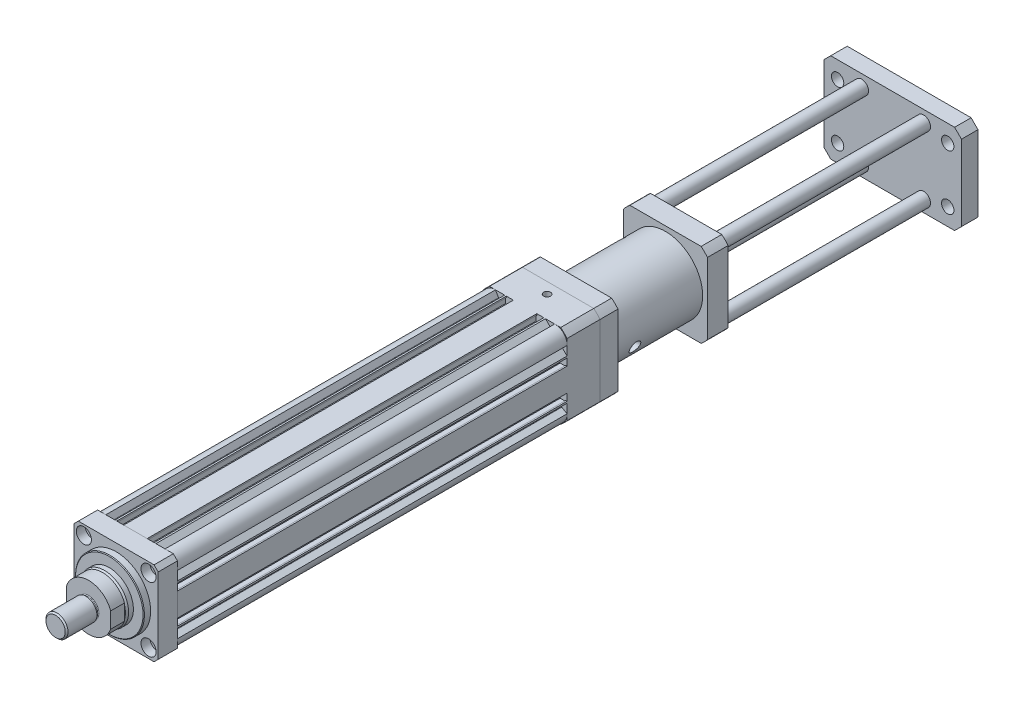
from build123d import *

# Parameters (mm, degrees)
SKETCH_1_R           = 25
SKETCH_1_R_2         = 2.594
EXTRUDE_1_DEPTH      = 283
EXTRUDE_1_2_DEPTH    = 14
SKETCH_3_R           = 4.5
SKETCH_3_R_2         = 3.5
CUT_EXTRUDE_3_DEPTH  = 14
SKETCH_3_5_R         = 5.5
CUT_EXTRUDE_4_DEPTH  = 6.5
SKETCH_5_R           = 25
EXTRUDE_2_DEPTH      = 5
CHAMFER_1_SIZE       = 0.5
SKETCH_6_R           = 17.5
EXTRUDE_3_DEPTH      = 5
CHAMFER_2_SIZE       = 1.5
CHAMFER_2_SIZE2      = 0.8
EXTRUDE_4_DEPTH      = 10
SKETCH_8_R           = 7
EXTRUDE_5_DEPTH      = 2
SKETCH_9_R           = 8
EXTRUDE_6_DEPTH      = 22
CHAMFER_3_SIZE       = 1
FILLET_1_R           = 0.5
SKETCH_10_W          = 61
SKETCH_10_H          = 61
EXTRUDE_7_DEPTH      = 24
SKETCH_11_R          = 50
SKETCH_11_R_2        = 40
CUT_EXTRUDE_1_DEPTH  = 24
SKETCH_16_W          = 61
SKETCH_16_H          = 61
EXTRUDE_8_DEPTH      = 13
SKETCH_18_R          = 3.5
CUT_EXTRUDE_5_DEPTH  = 13
SKETCH_19_R          = 27
EXTRUDE_9_DEPTH      = 65
SKETCH_20_W          = 61
SKETCH_20_H          = 61
EXTRUDE_10_DEPTH     = 15
SKETCH_21_R          = 2.5
CUT_EXTRUDE_6_DEPTH  = 10
SKETCH_22_R          = 50
SKETCH_22_R_2        = 40
CUT_EXTRUDE_2_DEPTH  = 93
SKETCH_23_R          = 21
CUT_EXTRUDE_7_DEPTH  = 80
SKETCH_23_3_R        = 25
CUT_EXTRUDE_8_DEPTH  = 7
SKETCH_24_R          = 4
CUT_EXTRUDE_9_DEPTH  = 27
SKETCH_25_R          = 4
CUT_EXTRUDE_10_DEPTH = 27
SKETCH_26_R          = 25
EXTRUDE_11_DEPTH     = 1
EXTRUDE_START        = 150
SKETCH_27_W          = 100
SKETCH_27_H          = 65
SKETCH_27_R          = 4.5
EXTRUDE_12_DEPTH     = 12
SKETCH_28_R          = 5
EXTRUDE_13_DEPTH     = 150
EXTRUDE_13_2_DEPTH   = 150
EXTRUDE_13_3_DEPTH   = 150
EXTRUDE_13_4_DEPTH   = 150
CHAMFER_4_SIZE       = 5


with BuildPart() as part:
    # Sketch 1 → Extrude 1 (new body)
    with BuildSketch(Plane.XY):
        with BuildLine():
            Line((30.5, 8.5), (29.5, 8.5))
            Line((29.5, 8.5), (29.5, 7.9))
            Line((29.5, 7.9), (25.5, 7.9))
            Line((25.5, 7.9), (25.5, 14.2))
            Line((25.5, 14.2), (29.5, 14.2))
            Line((29.5, 14.2), (29.5, 13.6))
            Line((29.5, 13.6), (30.5, 13.6))
            Line((30.5, 13.6), (30.5, 14.843551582))
            Line((30.5, 14.843551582), (26.602512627, 18.741038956))
            ThreePointArc((26.602512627, 18.741038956), (26.502994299, 19.034210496), (26.675, 19.29163522))
            Line((26.675, 19.29163522), (30.5, 21.5))
            ThreePointArc((30.5, 21.5), (28.010599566, 28.010599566), (21.5, 30.5))
            Line((21.5, 30.5), (19.29163522, 26.675))
            ThreePointArc((19.29163522, 26.675), (19.034210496, 26.502994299), (18.741038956, 26.602512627))
            Line((18.741038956, 26.602512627), (14.843551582, 30.5))
            Line((14.843551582, 30.5), (13.6, 30.5))
            Line((13.6, 30.5), (13.6, 29.5))
            Line((13.6, 29.5), (14.2, 29.5))
            Line((14.2, 29.5), (14.2, 25.5))
            Line((14.2, 25.5), (7.9, 25.5))
            Line((7.9, 25.5), (7.9, 29.5))
            Line((7.9, 29.5), (8.5, 29.5))
            Line((8.5, 29.5), (8.5, 30.5))
            Line((8.5, 30.5), (-8.5, 30.5))
            Line((-8.5, 30.5), (-8.5, 29.5))
            Line((-8.5, 29.5), (-7.9, 29.5))
            Line((-7.9, 29.5), (-7.9, 25.5))
            Line((-7.9, 25.5), (-14.2, 25.5))
            Line((-14.2, 25.5), (-14.2, 29.5))
            Line((-14.2, 29.5), (-13.6, 29.5))
            Line((-13.6, 29.5), (-13.6, 30.5))
            Line((-13.6, 30.5), (-14.843551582, 30.5))
            Line((-14.843551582, 30.5), (-18.741038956, 26.602512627))
            ThreePointArc((-18.741038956, 26.602512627), (-19.034210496, 26.502994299), (-19.29163522, 26.675))
            Line((-19.29163522, 26.675), (-21.5, 30.5))
            ThreePointArc((-21.5, 30.5), (-28.010599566, 28.010599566), (-30.5, 21.5))
            Line((-30.5, 21.5), (-26.675, 19.29163522))
            ThreePointArc((-26.675, 19.29163522), (-26.502994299, 19.034210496), (-26.602512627, 18.741038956))
            Line((-26.602512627, 18.741038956), (-30.5, 14.843551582))
            Line((-30.5, 14.843551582), (-30.5, 13.6))
            Line((-30.5, 13.6), (-29.5, 13.6))
            Line((-29.5, 13.6), (-29.5, 14.2))
            Line((-29.5, 14.2), (-25.5, 14.2))
            Line((-25.5, 14.2), (-25.5, 7.9))
            Line((-25.5, 7.9), (-29.5, 7.9))
            Line((-29.5, 7.9), (-29.5, 8.5))
            Line((-29.5, 8.5), (-30.5, 8.5))
            Line((-30.5, 8.5), (-30.5, -8.5))
            Line((-30.5, -8.5), (-29.5, -8.5))
            Line((-29.5, -8.5), (-29.5, -7.9))
            Line((-29.5, -7.9), (-25.5, -7.9))
            Line((-25.5, -7.9), (-25.5, -14.2))
            Line((-25.5, -14.2), (-29.5, -14.2))
            Line((-29.5, -14.2), (-29.5, -13.6))
            Line((-29.5, -13.6), (-30.5, -13.6))
            Line((-30.5, -13.6), (-30.5, -14.843551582))
            Line((-30.5, -14.843551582), (-26.602512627, -18.741038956))
            ThreePointArc((-26.602512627, -18.741038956), (-26.502994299, -19.034210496), (-26.675, -19.29163522))
            Line((-26.675, -19.29163522), (-30.5, -21.5))
            ThreePointArc((-30.5, -21.5), (-27.825897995, -28.191225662), (-21, -30.5))
            Line((-21, -30.5), (-18.79163522, -26.675))
            ThreePointArc((-18.79163522, -26.675), (-18.534210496, -26.502994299), (-18.241038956, -26.602512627))
            Line((-18.241038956, -26.602512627), (-14.343551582, -30.5))
            Line((-14.343551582, -30.5), (14.343551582, -30.5))
            Line((14.343551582, -30.5), (18.241038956, -26.602512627))
            ThreePointArc((18.241038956, -26.602512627), (18.534210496, -26.502994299), (18.79163522, -26.675))
            Line((18.79163522, -26.675), (21, -30.5))
            ThreePointArc((21, -30.5), (27.825897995, -28.191225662), (30.5, -21.5))
            Line((30.5, -21.5), (26.675, -19.29163522))
            ThreePointArc((26.675, -19.29163522), (26.502994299, -19.034210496), (26.602512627, -18.741038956))
            Line((26.602512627, -18.741038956), (30.5, -14.843551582))
            Line((30.5, -14.843551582), (30.5, -13.6))
            Line((30.5, -13.6), (29.5, -13.6))
            Line((29.5, -13.6), (29.5, -14.2))
            Line((29.5, -14.2), (25.5, -14.2))
            Line((25.5, -14.2), (25.5, -7.9))
            Line((25.5, -7.9), (29.5, -7.9))
            Line((29.5, -7.9), (29.5, -8.5))
            Line((29.5, -8.5), (30.5, -8.5))
            Line((30.5, -8.5), (30.5, 8.5))
        make_face()
        Circle(SKETCH_1_R, mode=Mode.SUBTRACT)
        with Locations((23.5, -23.5)):
            Circle(SKETCH_1_R_2, mode=Mode.SUBTRACT)
        with Locations((-23.5, -23.5)):
            Circle(SKETCH_1_R_2, mode=Mode.SUBTRACT)
        with Locations((23.5, 23.5)):
            Circle(SKETCH_1_R_2, mode=Mode.SUBTRACT)
        with Locations((-23.5, 23.5)):
            Circle(SKETCH_1_R_2, mode=Mode.SUBTRACT)
        with BuildLine():
            Line((-14.843484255, -26.551505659), (-5.699422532, -26.551505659))
            ThreePointArc((-5.699422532, -26.551505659), (-5.401016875, -26.282393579), (-5.637974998, -25.957866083))
            ThreePointArc((-5.637974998, -25.957866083), (-10.496775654, -24.470016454), (-15.006657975, -22.128520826))
            ThreePointArc((-15.006657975, -22.128520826), (-15.31244973, -22.117932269), (-15.468484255, -22.381131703))
            Line((-15.468484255, -22.381131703), (-15.468484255, -25.926505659))
            Line((-15.468484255, -25.926505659), (-14.843484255, -26.551505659))
        make_face(mode=Mode.SUBTRACT)
        with BuildLine():
            Line((15.037740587, -26.551505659), (5.893678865, -26.551505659))
            ThreePointArc((5.893678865, -26.551505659), (5.595273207, -26.282393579), (5.832231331, -25.957866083))
            ThreePointArc((5.832231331, -25.957866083), (10.691031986, -24.470016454), (15.200914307, -22.128520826))
            ThreePointArc((15.200914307, -22.128520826), (15.506706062, -22.117932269), (15.662740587, -22.381131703))
            Line((15.662740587, -22.381131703), (15.662740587, -25.926505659))
            Line((15.662740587, -25.926505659), (15.037740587, -26.551505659))
        make_face(mode=Mode.SUBTRACT)
        with BuildLine():
            Line((24.057261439, -13.884764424), (23.358946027, -13.481591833))
            ThreePointArc((23.358946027, -13.481591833), (23.055418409, -13.441631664), (22.812535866, -13.628001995))
            Line((22.812535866, -13.628001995), (21.480305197, -15.935493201))
            ThreePointArc((21.480305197, -15.935493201), (21.440345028, -16.239020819), (21.626715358, -16.481903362))
            Line((21.626715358, -16.481903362), (22.892186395, -17.212523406))
            ThreePointArc((22.892186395, -17.212523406), (23.195714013, -17.252483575), (23.438596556, -17.066113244))
            Line((23.438596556, -17.066113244), (24.274264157, -15.618694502))
            ThreePointArc((24.274264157, -15.618694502), (24.317966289, -15.507082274), (24.326638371, -15.387533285))
            Line((24.326638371, -15.387533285), (24.223757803, -14.070923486))
            ThreePointArc((24.223757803, -14.070923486), (24.155411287, -13.964516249), (24.057261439, -13.884764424))
        make_face(mode=Mode.SUBTRACT)
        with BuildLine():
            Line((-24.057261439, -13.884764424), (-23.358946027, -13.481591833))
            ThreePointArc((-23.358946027, -13.481591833), (-23.055418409, -13.441631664), (-22.812535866, -13.628001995))
            Line((-22.812535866, -13.628001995), (-21.480305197, -15.935493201))
            ThreePointArc((-21.480305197, -15.935493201), (-21.440345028, -16.239020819), (-21.626715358, -16.481903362))
            Line((-21.626715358, -16.481903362), (-22.892186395, -17.212523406))
            ThreePointArc((-22.892186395, -17.212523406), (-23.195714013, -17.252483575), (-23.438596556, -17.066113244))
            Line((-23.438596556, -17.066113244), (-24.274264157, -15.618694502))
            ThreePointArc((-24.274264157, -15.618694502), (-24.317966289, -15.507082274), (-24.326638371, -15.387533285))
            Line((-24.326638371, -15.387533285), (-24.223757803, -14.070923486))
            ThreePointArc((-24.223757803, -14.070923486), (-24.155411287, -13.964516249), (-24.057261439, -13.884764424))
        make_face(mode=Mode.SUBTRACT)
        with BuildLine():
            Line((24.057261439, 13.884764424), (23.358946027, 13.481591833))
            ThreePointArc((23.358946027, 13.481591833), (23.055418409, 13.441631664), (22.812535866, 13.628001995))
            Line((22.812535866, 13.628001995), (21.480305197, 15.935493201))
            ThreePointArc((21.480305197, 15.935493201), (21.440345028, 16.239020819), (21.626715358, 16.481903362))
            Line((21.626715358, 16.481903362), (22.892186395, 17.212523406))
            ThreePointArc((22.892186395, 17.212523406), (23.195714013, 17.252483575), (23.438596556, 17.066113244))
            Line((23.438596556, 17.066113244), (24.274264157, 15.618694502))
            ThreePointArc((24.274264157, 15.618694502), (24.317966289, 15.507082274), (24.326638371, 15.387533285))
            Line((24.326638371, 15.387533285), (24.223757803, 14.070923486))
            ThreePointArc((24.223757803, 14.070923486), (24.155411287, 13.964516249), (24.057261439, 13.884764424))
        make_face(mode=Mode.SUBTRACT)
        with BuildLine():
            Line((-24.057261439, 13.884764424), (-23.358946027, 13.481591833))
            ThreePointArc((-23.358946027, 13.481591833), (-23.055418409, 13.441631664), (-22.812535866, 13.628001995))
            Line((-22.812535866, 13.628001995), (-21.480305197, 15.935493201))
            ThreePointArc((-21.480305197, 15.935493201), (-21.440345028, 16.239020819), (-21.626715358, 16.481903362))
            Line((-21.626715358, 16.481903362), (-22.892186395, 17.212523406))
            ThreePointArc((-22.892186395, 17.212523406), (-23.195714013, 17.252483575), (-23.438596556, 17.066113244))
            Line((-23.438596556, 17.066113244), (-24.274264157, 15.618694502))
            ThreePointArc((-24.274264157, 15.618694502), (-24.317966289, 15.507082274), (-24.326638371, 15.387533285))
            Line((-24.326638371, 15.387533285), (-24.223757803, 14.070923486))
            ThreePointArc((-24.223757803, 14.070923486), (-24.155411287, 13.964516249), (-24.057261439, 13.884764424))
        make_face(mode=Mode.SUBTRACT)
        with BuildLine():
            Line((17.761634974, 23.75411276), (17.07315308, 24.68624059))
            ThreePointArc((17.07315308, 24.68624059), (16.934629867, 24.812286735), (16.758415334, 24.87572765))
            Line((16.758415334, 24.87572765), (13.966108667, 25.295529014))
            ThreePointArc((13.966108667, 25.295529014), (13.689318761, 25.25468305), (13.482325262, 25.066441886))
            Line((13.482325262, 25.066441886), (12.839111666, 23.986237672))
            ThreePointArc((12.839111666, 23.986237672), (12.785382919, 23.626185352), (12.999780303, 23.331977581))
            ThreePointArc((12.999780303, 23.331977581), (14.833000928, 22.112125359), (16.576342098, 20.766949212))
            ThreePointArc((16.576342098, 20.766949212), (17.053890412, 20.688035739), (17.357364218, 21.065107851))
            Line((17.357364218, 21.065107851), (17.761634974, 23.75411276))
        make_face(mode=Mode.SUBTRACT)
        with BuildLine():
            Line((-17.761634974, 23.75411276), (-17.07315308, 24.68624059))
            ThreePointArc((-17.07315308, 24.68624059), (-16.934629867, 24.812286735), (-16.758415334, 24.87572765))
            Line((-16.758415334, 24.87572765), (-13.966108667, 25.295529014))
            ThreePointArc((-13.966108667, 25.295529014), (-13.689318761, 25.25468305), (-13.482325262, 25.066441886))
            Line((-13.482325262, 25.066441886), (-12.839111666, 23.986237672))
            ThreePointArc((-12.839111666, 23.986237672), (-12.785382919, 23.626185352), (-12.999780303, 23.331977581))
            ThreePointArc((-12.999780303, 23.331977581), (-14.833000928, 22.112125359), (-16.576342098, 20.766949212))
            ThreePointArc((-16.576342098, 20.766949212), (-17.053890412, 20.688035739), (-17.357364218, 21.065107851))
            Line((-17.357364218, 21.065107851), (-17.761634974, 23.75411276))
        make_face(mode=Mode.SUBTRACT)
    extrude(amount=EXTRUDE_1_DEPTH)

    # Sketch 10 → Extrude 7 (add)
    with BuildSketch(Plane(origin=(0, 0, 0), x_dir=(-1, 0, 0), z_dir=(0, 0, -1))):
        Rectangle(SKETCH_10_W, SKETCH_10_H)
    extrude(amount=EXTRUDE_7_DEPTH)

    # Sketch 11 → Cut-Extrude 1 (cut)
    with BuildSketch(Plane(origin=(0, 0, -24), x_dir=(-1, 0, 0), z_dir=(0, 0, -1))):
        Circle(SKETCH_11_R)
        Circle(SKETCH_11_R_2, mode=Mode.SUBTRACT)
    extrude(amount=-CUT_EXTRUDE_1_DEPTH, mode=Mode.SUBTRACT)

    # Sketch 15 → Hole Wizard M6 _1 (revolve, cut)
    with BuildSketch(Plane(origin=(0, 30.5, -16), x_dir=(0, 0, 1), z_dir=(1, 0, 0))):
        Polygon((0, 0), (0, 9.502151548), (2.5, 8), (2.5, 0), align=None)
    revolve(axis=Axis((0, 36.85, -16), (0, -1, 0)), mode=Mode.SUBTRACT)


with BuildPart() as body_2:
    # Sketch 2 → Extrude 1 2 (new body)
    with BuildSketch(Plane.XY.offset(283)):
        Polygon((-27.5, 30.5), (-30.5, 27.5), (-30.5, -27.5), (-27.5, -30.5), (27.5, -30.5), (30.5, -27.5), (30.5, 27.5), (27.5, 30.5), align=None)
    extrude(amount=EXTRUDE_1_2_DEPTH)

    # Sketch 3 → Cut-Extrude 3 (cut)
    with BuildSketch(Plane.XY.offset(297)):
        with Locations((-40, -20)):
            Circle(SKETCH_3_R)
        with Locations((-23.5, -23.5)):
            Circle(SKETCH_3_R_2)
        with Locations((-23.5, 23.5)):
            Circle(SKETCH_3_R_2)
        with Locations((23.5, 23.5)):
            Circle(SKETCH_3_R_2)
        with Locations((40, 20)):
            Circle(SKETCH_3_R)
        with Locations((40, -20)):
            Circle(SKETCH_3_R)
        with Locations((23.5, -23.5)):
            Circle(SKETCH_3_R_2)
        with Locations((-40, 20)):
            Circle(SKETCH_3_R)
    extrude(amount=-CUT_EXTRUDE_3_DEPTH, mode=Mode.SUBTRACT)

    # Sketch 3_5 → Cut-Extrude 4 (cut)
    with BuildSketch(Plane.XY.offset(297)):
        with Locations((-23.5, 23.5)):
            Circle(SKETCH_3_5_R)
        with Locations((-23.5, -23.5)):
            Circle(SKETCH_3_5_R)
        with Locations((23.5, -23.5)):
            Circle(SKETCH_3_5_R)
        with Locations((23.5, 23.5)):
            Circle(SKETCH_3_5_R)
    extrude(amount=-CUT_EXTRUDE_4_DEPTH, mode=Mode.SUBTRACT)

    # Sketch 5 → Extrude 2 (add)
    with BuildSketch(Plane.XY.offset(297)):
        Circle(SKETCH_5_R)
    extrude(amount=EXTRUDE_2_DEPTH)

    # Chamfer 1
    chamfer_1_edges = [body_2.edges().sort_by_distance(p)[0] for p in [
        (-25, 0, 302),
    ]]
    chamfer(chamfer_1_edges, length=CHAMFER_1_SIZE)

    # Sketch 6 → Extrude 3 (add)
    with BuildSketch(Plane.XY.offset(302)):
        Circle(SKETCH_6_R)
    extrude(amount=EXTRUDE_3_DEPTH)

    # Chamfer 2
    chamfer_2_edges = [body_2.edges().sort_by_distance(p)[0] for p in [
        (-17.5, 0, 307),
    ]]
    chamfer_2_side = [body_2.faces().sort_by_distance(p)[0] for p in [
        (-17.5, 0, 304.5),
    ]]
    chamfer(chamfer_2_edges, length=CHAMFER_2_SIZE, length2=CHAMFER_2_SIZE2, reference=chamfer_2_side[0])

    # Sketch 7 → Extrude 4 (add)
    with BuildSketch(Plane.XY.offset(307)):
        with BuildLine():
            Line((-16, 5.744562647), (-16, -5.744562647))
            ThreePointArc((-16, -5.744562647), (0, -17), (16, -5.744562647))
            Line((16, -5.744562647), (16, 5.744562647))
            ThreePointArc((16, 5.744562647), (0, 17), (-16, 5.744562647))
        make_face()
    extrude(amount=EXTRUDE_4_DEPTH)

    # Sketch 8 → Extrude 5 (add)
    with BuildSketch(Plane.XY.offset(317)):
        Circle(SKETCH_8_R)
    extrude(amount=EXTRUDE_5_DEPTH)

    # Sketch 9 → Extrude 6 (add)
    with BuildSketch(Plane.XY.offset(319)):
        Circle(SKETCH_9_R)
    extrude(amount=EXTRUDE_6_DEPTH)

    # Chamfer 3
    chamfer_3_edges = [body_2.edges().sort_by_distance(p)[0] for p in [
        (-8, 0, 341),
    ]]
    chamfer(chamfer_3_edges, length=CHAMFER_3_SIZE)

    # Fillet 1
    fillet_1_edges = [body_2.edges().sort_by_distance(p)[0] for p in [
        (-7, 0, 317),
    ]]
    fillet(fillet_1_edges, radius=FILLET_1_R)


with BuildPart() as body_3:
    # Sketch 16 → Extrude 8 (new body)
    with BuildSketch(Plane(origin=(0, 0, -24), x_dir=(-1, 0, 0), z_dir=(0, 0, -1))):
        Rectangle(SKETCH_16_W, SKETCH_16_H)
    extrude(amount=EXTRUDE_8_DEPTH)

    # Sketch 18 → Cut-Extrude 5 (cut)
    with BuildSketch(Plane(origin=(0, 0, -37), x_dir=(-1, 0, 0), z_dir=(0, 0, -1))):
        with Locations((-23.5, 23.5)):
            Circle(SKETCH_18_R)
        with Locations((-23.5, -23.5)):
            Circle(SKETCH_18_R)
        with Locations((23.5, -23.5)):
            Circle(SKETCH_18_R)
        with Locations((23.5, 23.5)):
            Circle(SKETCH_18_R)
    extrude(amount=-CUT_EXTRUDE_5_DEPTH, mode=Mode.SUBTRACT)

    # Sketch 19 → Extrude 9 (add)
    with BuildSketch(Plane(origin=(0, 0, -37), x_dir=(-1, 0, 0), z_dir=(0, 0, -1))):
        Circle(SKETCH_19_R)
    extrude(amount=EXTRUDE_9_DEPTH)

    # Sketch 20 → Extrude 10 (add)
    with BuildSketch(Plane(origin=(0, 0, -102), x_dir=(-1, 0, 0), z_dir=(0, 0, -1))):
        Rectangle(SKETCH_20_W, SKETCH_20_H)
    extrude(amount=EXTRUDE_10_DEPTH)

    # Sketch 21 → Cut-Extrude 6 (cut)
    with BuildSketch(Plane(origin=(0, 0, -117), x_dir=(-1, 0, 0), z_dir=(0, 0, -1))):
        with Locations((-24.748737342, 24.748737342)):
            Circle(SKETCH_21_R)
        with Locations((24.748737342, 24.748737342)):
            Circle(SKETCH_21_R)
        with Locations((24.748737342, -24.748737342)):
            Circle(SKETCH_21_R)
        with Locations((-24.748737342, -24.748737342)):
            Circle(SKETCH_21_R)
    extrude(amount=-CUT_EXTRUDE_6_DEPTH, mode=Mode.SUBTRACT)

    # Sketch 22 → Cut-Extrude 2 (cut)
    with BuildSketch(Plane(origin=(0, 0, -117), x_dir=(-1, 0, 0), z_dir=(0, 0, -1))):
        Circle(SKETCH_22_R)
        Circle(SKETCH_22_R_2, mode=Mode.SUBTRACT)
    extrude(amount=-CUT_EXTRUDE_2_DEPTH, mode=Mode.SUBTRACT)

    # Sketch 23 → Cut-Extrude 7 (cut)
    with BuildSketch(Plane(origin=(0, 0, -117), x_dir=(-1, 0, 0), z_dir=(0, 0, -1))):
        Circle(SKETCH_23_R)
    extrude(amount=-CUT_EXTRUDE_7_DEPTH, mode=Mode.SUBTRACT)

    # Sketch 23_3 → Cut-Extrude 8 (cut)
    with BuildSketch(Plane(origin=(0, 0, -117), x_dir=(-1, 0, 0), z_dir=(0, 0, -1))):
        Circle(SKETCH_23_3_R)
    extrude(amount=-CUT_EXTRUDE_8_DEPTH, mode=Mode.SUBTRACT)

    # Sketch 24 → Cut-Extrude 9 (cut)
    with BuildSketch(Plane.ZY.offset(30.5)):
        with Locations(Location((-88.78323725, 17.446251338, 0), (0, 0, 270))):
            Circle(SKETCH_24_R)
    extrude(amount=-CUT_EXTRUDE_9_DEPTH, mode=Mode.SUBTRACT)

    # Sketch 25 → Cut-Extrude 10 (cut)
    with BuildSketch(Plane(origin=(30.5, 0, 0), x_dir=(0, 0, -1), z_dir=(1, 0, 0))):
        with Locations((54.542092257, -9.414024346)):
            Circle(SKETCH_25_R)
    extrude(amount=-CUT_EXTRUDE_10_DEPTH, mode=Mode.SUBTRACT)

    # Sketch 26 → Extrude 11 (add)
    with BuildSketch(Plane(origin=(0, 0, -117), x_dir=(-1, 0, 0), z_dir=(0, 0, -1))):
        Circle(SKETCH_26_R)
    extrude(amount=-EXTRUDE_11_DEPTH)


with BuildPart() as body_4:
    # Sketch 27 → Extrude 12 (new body)
    with BuildSketch(Plane(origin=(0, 0, -117), x_dir=(-1, 0, 0), z_dir=(0, 0, -1)).offset(EXTRUDE_START)):
        Rectangle(SKETCH_27_W, SKETCH_27_H)
        with Locations((-40, 20)):
            Circle(SKETCH_27_R, mode=Mode.SUBTRACT)
        with Locations((-40, -20)):
            Circle(SKETCH_27_R, mode=Mode.SUBTRACT)
        with Locations(Location((40, -20, 0), (0, 0, 180))):
            Circle(SKETCH_27_R, mode=Mode.SUBTRACT)
        with Locations(Location((40, 20, 0), (0, 0, 180))):
            Circle(SKETCH_27_R, mode=Mode.SUBTRACT)
    extrude(amount=EXTRUDE_12_DEPTH)

    # Chamfer 4
    chamfer_4_edges = [body_4.edges().sort_by_distance(p)[0] for p in [
        (-50, -32.5, -273),
        (50, -32.5, -273),
        (50, 32.5, -273),
        (-50, 32.5, -273),
    ]]
    chamfer(chamfer_4_edges, length=CHAMFER_4_SIZE)


with BuildPart() as body_5:
    # Sketch 28 → Extrude 13 (new body)
    with BuildSketch(Plane(origin=(0, 0, -117), x_dir=(-1, 0, 0), z_dir=(0, 0, -1))):
        with Locations((-22.5, 24)):
            Circle(SKETCH_28_R)
    extrude(amount=EXTRUDE_13_DEPTH)


with BuildPart() as body_6:
    # Sketch 28 → Extrude 13 2 (new body)
    with BuildSketch(Plane(origin=(0, 0, -117), x_dir=(-1, 0, 0), z_dir=(0, 0, -1))):
        with Locations((22.5, 24)):
            Circle(SKETCH_28_R)
    extrude(amount=EXTRUDE_13_2_DEPTH)


with BuildPart() as body_7:
    # Sketch 28 → Extrude 13 3 (new body)
    with BuildSketch(Plane(origin=(0, 0, -117), x_dir=(-1, 0, 0), z_dir=(0, 0, -1))):
        with Locations((22.5, -24)):
            Circle(SKETCH_28_R)
    extrude(amount=EXTRUDE_13_3_DEPTH)


with BuildPart() as body_8:
    # Sketch 28 → Extrude 13 4 (new body)
    with BuildSketch(Plane(origin=(0, 0, -117), x_dir=(-1, 0, 0), z_dir=(0, 0, -1))):
        with Locations((-22.5, -24)):
            Circle(SKETCH_28_R)
    extrude(amount=EXTRUDE_13_4_DEPTH)


solid = Compound([part.part, body_2.part, body_3.part, body_4.part, body_5.part, body_6.part, body_7.part, body_8.part])
